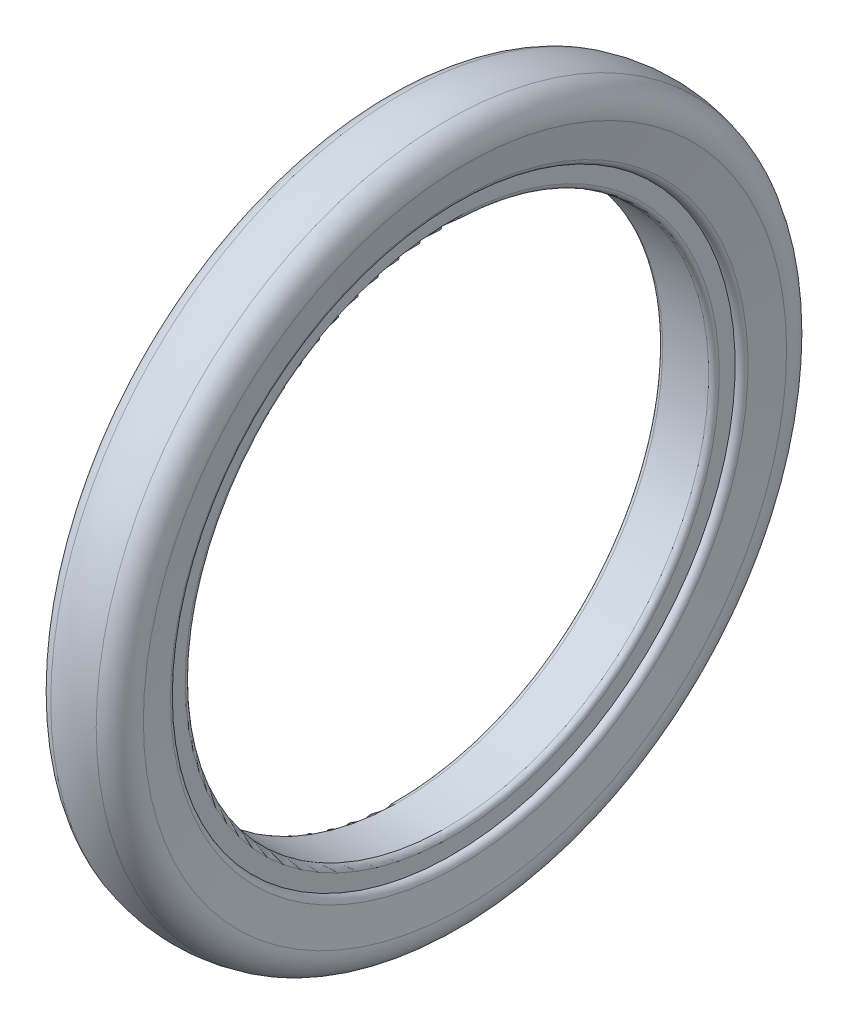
from build123d import *


with BuildPart() as part:
    # Sketch2 → Revolve1 (revolve)
    with BuildSketch(Plane.XY, mode=Mode.PRIVATE) as revolve1_sk:
        with BuildLine():
            Line((-20.6248, 234.95), (20.6248, 234.95))
            ThreePointArc((20.6248, 234.95), (24.001376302, 236.348623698), (25.4, 239.7252))
            Line((25.4, 239.7252), (25.4, 254))
            Line((25.4, 254), (-25.4, 254))
            Line((-25.4, 254), (-25.4, 239.7252))
            ThreePointArc((-25.4, 239.7252), (-24.001376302, 236.348623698), (-20.6248, 234.95))
        make_face()
    revolve(revolve1_sk.sketch.rotate(Axis((0, 0, 0), (1, 0, 0)), 90), axis=Axis((0, 0, 0), (1, 0, 0)))


with BuildPart() as body_2:
    # Sketch3 → Revolve2 (revolve)
    with BuildSketch(Plane.XY, mode=Mode.PRIVATE) as revolve2_sk:
        with BuildLine():
            Line((-25.4, 254), (25.4, 254))
            ThreePointArc((25.4, 254), (29.485731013, 255.489001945), (31.655348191, 259.25770013))
            Line((31.655348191, 259.25770013), (36.806753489, 288.758604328))
            ThreePointArc((36.806753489, 288.758604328), (33.614643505, 304.899123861), (20.410714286, 314.715548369))
            ThreePointArc((20.410714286, 314.715548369), (0, 317.5), (-20.410714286, 314.715548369))
            ThreePointArc((-20.410714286, 314.715548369), (-33.614643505, 304.899123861), (-36.806753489, 288.758604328))
            Line((-36.806753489, 288.758604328), (-31.655348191, 259.25770013))
            ThreePointArc((-31.655348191, 259.25770013), (-29.485731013, 255.489001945), (-25.4, 254))
        make_face()
    revolve(revolve2_sk.sketch.rotate(Axis((0, 0, 0), (1, 0, 0)), 90), axis=Axis((0, 0, 0), (1, 0, 0)))


solid = Compound([part.part, body_2.part])
